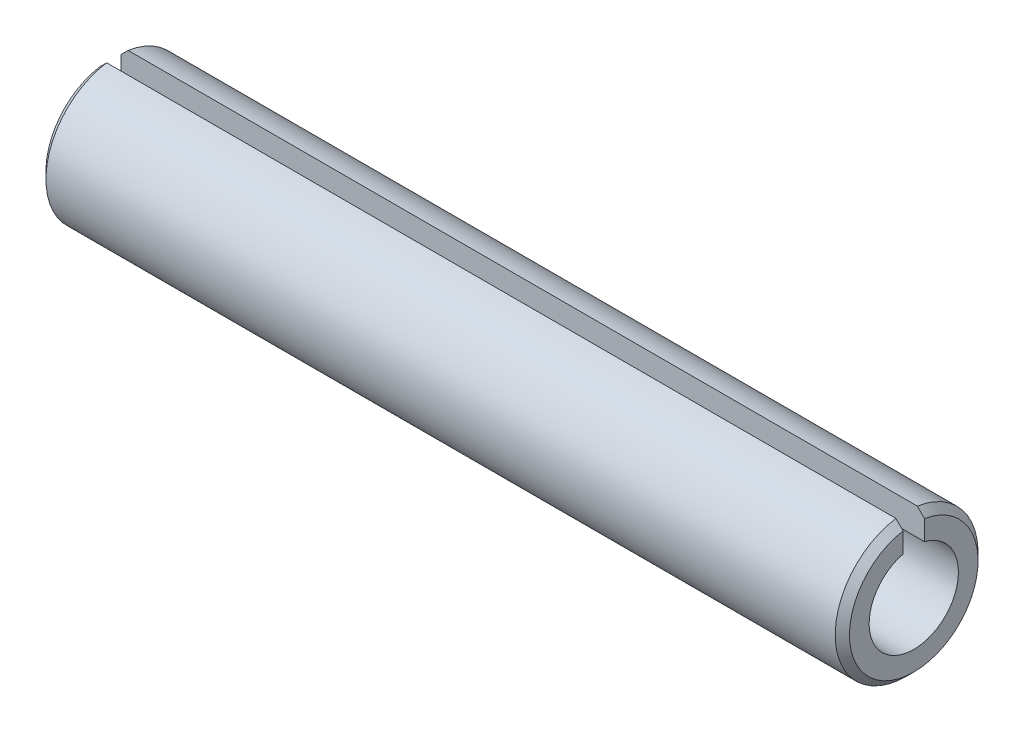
from build123d import *

# Parameters (mm, degrees)
ENL_V_MAT_EXTRU_2_DEPTH = 46.354161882


with BuildPart() as part:
    # Esquisse1 → Base-R_volution (revolve)
    with BuildSketch(Plane.XY):
        Polygon((0, 2.5), (0, 3.6), (0.4, 4), (44.6, 4), (45, 3.6), (45, 2.5), align=None)
    revolve(axis=Axis((0, 0, 0), (1, 0, 0)))

    # Esquisse2 → Enl_v. mat.-Extru.2 (cut, through all)
    with BuildSketch(Plane(origin=(0, 0, 0), x_dir=(0, 0, -1), z_dir=(1, 0, 0))):
        with BuildLine():
            Line((0.6, 3.954743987), (0.6, 2.42693222))
            ThreePointArc((0.6, 2.42693222), (0, 2.5), (-0.6, 2.42693222))
            Line((-0.6, 2.42693222), (-0.6, 3.954743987))
            ThreePointArc((-0.6, 3.954743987), (0, 4), (0.6, 3.954743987))
        make_face()
    extrude(amount=ENL_V_MAT_EXTRU_2_DEPTH, mode=Mode.SUBTRACT)


solid = part.part
